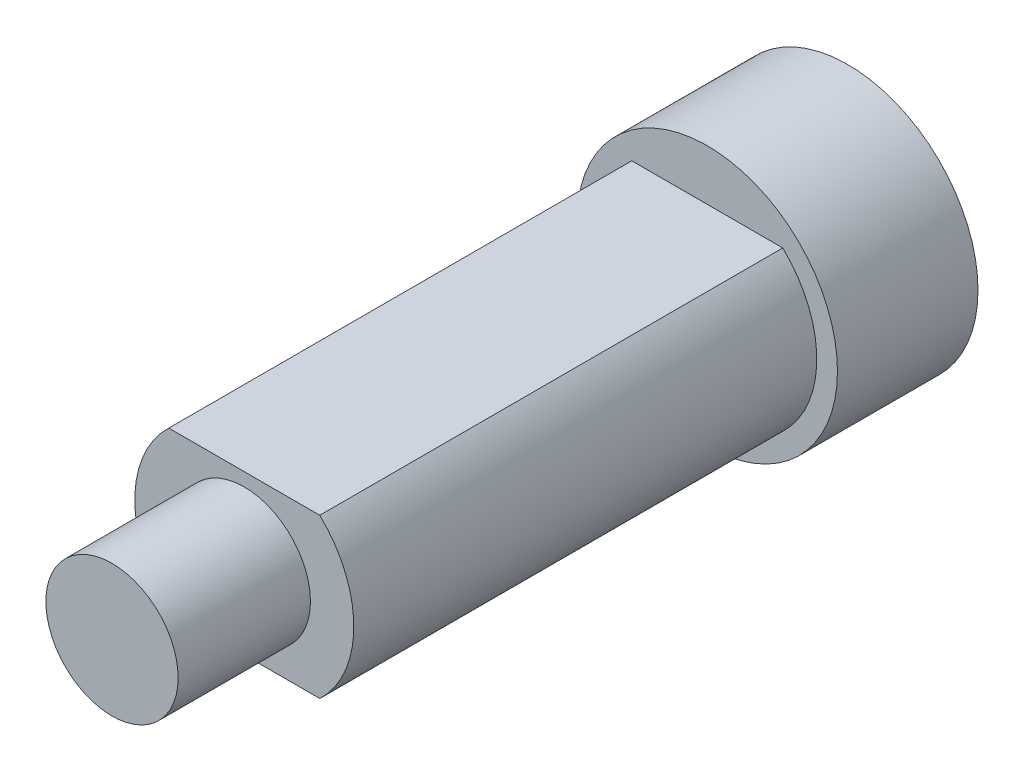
from build123d import *

# Parameters (mm, degrees)
SKETCH1_R      = 12.50061
EXTRUDE1_DEPTH = 13.49248
EXTRUDE2_DEPTH = 44.45
SKETCH3_R      = 6.35
EXTRUDE3_DEPTH = 12.7


with BuildPart() as part:
    # Sketch1 → Extrude1 (new body)
    with BuildSketch(Plane.XY):
        Circle(SKETCH1_R)
    extrude(amount=EXTRUDE1_DEPTH)

    # Sketch2 → Extrude2 (add)
    with BuildSketch(Plane.XY.offset(13.49248)):
        with BuildLine():
            Line((-7.248458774, 7.62), (7.248458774, 7.62))
            ThreePointArc((7.248458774, 7.62), (10.51687, 0), (7.248458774, -7.62))
            Line((7.248458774, -7.62), (-7.248458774, -7.62))
            ThreePointArc((-7.248458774, -7.62), (-10.51687, 0), (-7.248458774, 7.62))
        make_face()
    extrude(amount=EXTRUDE2_DEPTH)

    # Sketch3 → Extrude3 (add)
    with BuildSketch(Plane.XY.offset(57.94248)):
        Circle(SKETCH3_R)
    extrude(amount=EXTRUDE3_DEPTH)


solid = part.part
